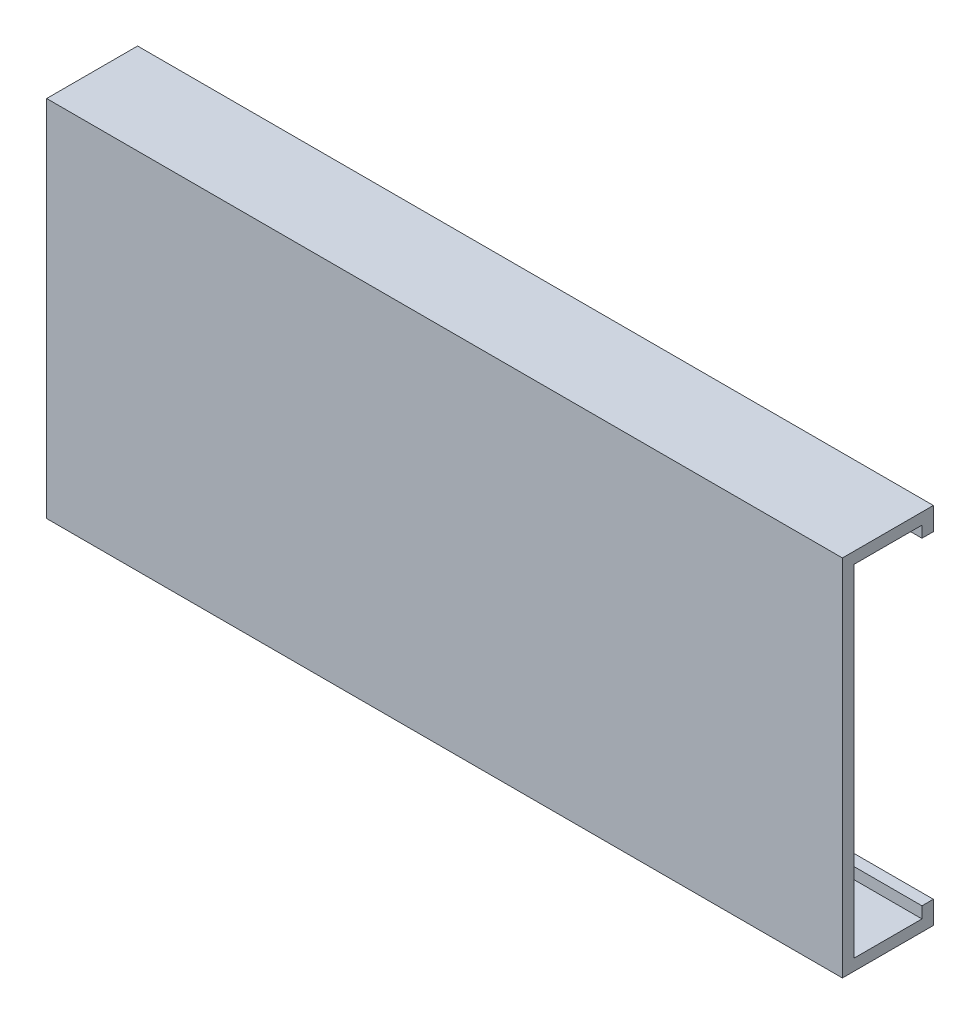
ISO-10303-21;
HEADER;
FILE_DESCRIPTION(('STEP AP214'),'2;1');
FILE_NAME('part.step','',(''),(''),'','','');
FILE_SCHEMA(('AUTOMOTIVE_DESIGN { 1 0 10303 214 1 1 1 1 }'));
ENDSEC;
DATA;
#1=APPLICATION_CONTEXT('core data for automotive mechanical design processes');
#2=APPLICATION_PROTOCOL_DEFINITION('international standard','automotive_design',2000,#1);
#3=PRODUCT_CONTEXT('',#1,'mechanical');
#4=PRODUCT('Part','Part','',(#3));
#5=PRODUCT_RELATED_PRODUCT_CATEGORY('part','',(#4));
#6=PRODUCT_DEFINITION_FORMATION('','',#4);
#7=PRODUCT_DEFINITION_CONTEXT('part definition',#1,'design');
#8=PRODUCT_DEFINITION('design','',#6,#7);
#9=PRODUCT_DEFINITION_SHAPE('','',#8);
#10=(LENGTH_UNIT() NAMED_UNIT(*) SI_UNIT(.MILLI.,.METRE.));
#11=(NAMED_UNIT(*) PLANE_ANGLE_UNIT() SI_UNIT($,.RADIAN.));
#12=(NAMED_UNIT(*) SI_UNIT($,.STERADIAN.) SOLID_ANGLE_UNIT());
#13=UNCERTAINTY_MEASURE_WITH_UNIT(LENGTH_MEASURE(1.E-05),#10,'distance_accuracy_value','');
#14=(GEOMETRIC_REPRESENTATION_CONTEXT(3) GLOBAL_UNCERTAINTY_ASSIGNED_CONTEXT((#13)) GLOBAL_UNIT_ASSIGNED_CONTEXT((#10,
#11,#12)) REPRESENTATION_CONTEXT('',''));
#15=CARTESIAN_POINT('',(0.,0.,0.));
#16=DIRECTION('',(0.,0.,1.));
#17=DIRECTION('',(1.,0.,0.));
#18=AXIS2_PLACEMENT_3D('',#15,#16,#17);
#19=CARTESIAN_POINT('',(35.,-15.,1.));
#20=DIRECTION('',(-1.,0.,0.));
#21=DIRECTION('',(0.,0.,1.));
#22=AXIS2_PLACEMENT_3D('',#19,#20,#21);
#23=PLANE('',#22);
#24=DIRECTION('',(0.,1.,0.));
#25=VECTOR('',#24,1.);
#26=CARTESIAN_POINT('',(35.,-15.,0.));
#27=LINE('',#26,#25);
#28=CARTESIAN_POINT('',(35.,-15.,0.));
#29=VERTEX_POINT('',#28);
#30=CARTESIAN_POINT('',(35.,15.,0.));
#31=VERTEX_POINT('',#30);
#32=EDGE_CURVE('E181',#29,#31,#27,.T.);
#33=ORIENTED_EDGE('',*,*,#32,.T.);
#34=DIRECTION('',(0.,0.,-1.));
#35=VECTOR('',#34,1.);
#36=CARTESIAN_POINT('',(35.,15.,1.));
#37=LINE('',#36,#35);
#38=CARTESIAN_POINT('',(35.,15.,-6.));
#39=VERTEX_POINT('',#38);
#40=EDGE_CURVE('E154',#31,#39,#37,.T.);
#41=ORIENTED_EDGE('',*,*,#40,.T.);
#42=DIRECTION('',(0.,-1.,0.));
#43=VECTOR('',#42,1.);
#44=CARTESIAN_POINT('',(35.,15.,-6.));
#45=LINE('',#44,#43);
#46=CARTESIAN_POINT('',(35.,14.,-6.));
#47=VERTEX_POINT('',#46);
#48=EDGE_CURVE('E202',#39,#47,#45,.T.);
#49=ORIENTED_EDGE('',*,*,#48,.T.);
#50=DIRECTION('',(0.,0.,-1.));
#51=VECTOR('',#50,1.);
#52=CARTESIAN_POINT('',(35.,14.,-7.));
#53=LINE('',#52,#51);
#54=CARTESIAN_POINT('',(35.,14.,-7.));
#55=VERTEX_POINT('',#54);
#56=EDGE_CURVE('E197',#47,#55,#53,.T.);
#57=ORIENTED_EDGE('',*,*,#56,.T.);
#58=DIRECTION('',(0.,-1.,0.));
#59=VECTOR('',#58,1.);
#60=CARTESIAN_POINT('',(35.,16.,-7.));
#61=LINE('',#60,#59);
#62=CARTESIAN_POINT('',(35.,16.,-7.));
#63=VERTEX_POINT('',#62);
#64=EDGE_CURVE('E179',#63,#55,#61,.T.);
#65=ORIENTED_EDGE('',*,*,#64,.F.);
#66=DIRECTION('',(0.,0.,-1.));
#67=VECTOR('',#66,1.);
#68=CARTESIAN_POINT('',(35.,16.,1.));
#69=LINE('',#68,#67);
#70=CARTESIAN_POINT('',(35.,16.,1.));
#71=VERTEX_POINT('',#70);
#72=EDGE_CURVE('E171',#71,#63,#69,.T.);
#73=ORIENTED_EDGE('',*,*,#72,.F.);
#74=DIRECTION('',(0.,1.,0.));
#75=VECTOR('',#74,1.);
#76=CARTESIAN_POINT('',(35.,-15.,1.));
#77=LINE('',#76,#75);
#78=CARTESIAN_POINT('',(35.,-16.,1.));
#79=VERTEX_POINT('',#78);
#80=EDGE_CURVE('E47',#79,#71,#77,.T.);
#81=ORIENTED_EDGE('',*,*,#80,.F.);
#82=DIRECTION('',(0.,0.,-1.));
#83=VECTOR('',#82,1.);
#84=CARTESIAN_POINT('',(35.,-16.,1.));
#85=LINE('',#84,#83);
#86=CARTESIAN_POINT('',(35.,-16.,-7.));
#87=VERTEX_POINT('',#86);
#88=EDGE_CURVE('E163',#79,#87,#85,.T.);
#89=ORIENTED_EDGE('',*,*,#88,.T.);
#90=DIRECTION('',(0.,-1.,0.));
#91=VECTOR('',#90,1.);
#92=CARTESIAN_POINT('',(35.,-15.,-7.));
#93=LINE('',#92,#91);
#94=CARTESIAN_POINT('',(35.,-14.,-7.));
#95=VERTEX_POINT('',#94);
#96=EDGE_CURVE('E212',#95,#87,#93,.T.);
#97=ORIENTED_EDGE('',*,*,#96,.F.);
#98=DIRECTION('',(0.,0.,1.));
#99=VECTOR('',#98,1.);
#100=CARTESIAN_POINT('',(35.,-14.,-7.));
#101=LINE('',#100,#99);
#102=CARTESIAN_POINT('',(35.,-14.,-6.));
#103=VERTEX_POINT('',#102);
#104=EDGE_CURVE('E145',#95,#103,#101,.T.);
#105=ORIENTED_EDGE('',*,*,#104,.T.);
#106=DIRECTION('',(0.,-1.,0.));
#107=VECTOR('',#106,1.);
#108=CARTESIAN_POINT('',(35.,-15.,-6.));
#109=LINE('',#108,#107);
#110=CARTESIAN_POINT('',(35.,-15.,-6.));
#111=VERTEX_POINT('',#110);
#112=EDGE_CURVE('E132',#103,#111,#109,.T.);
#113=ORIENTED_EDGE('',*,*,#112,.T.);
#114=DIRECTION('',(0.,0.,-1.));
#115=VECTOR('',#114,1.);
#116=CARTESIAN_POINT('',(35.,-15.,1.));
#117=LINE('',#116,#115);
#118=EDGE_CURVE('E143',#29,#111,#117,.T.);
#119=ORIENTED_EDGE('',*,*,#118,.F.);
#120=EDGE_LOOP('',(#33,#41,#49,#57,#65,#73,#81,#89,#97,#105,#113,#119));
#121=FACE_BOUND('',#120,.T.);
#122=ADVANCED_FACE('F39',(#121),#23,.F.);
#123=CARTESIAN_POINT('',(-35.,-15.,1.));
#124=DIRECTION('',(1.,0.,0.));
#125=DIRECTION('',(0.,0.,-1.));
#126=AXIS2_PLACEMENT_3D('',#123,#124,#125);
#127=PLANE('',#126);
#128=DIRECTION('',(0.,-1.,0.));
#129=VECTOR('',#128,1.);
#130=CARTESIAN_POINT('',(-35.,-15.,0.));
#131=LINE('',#130,#129);
#132=CARTESIAN_POINT('',(-35.,15.,0.));
#133=VERTEX_POINT('',#132);
#134=CARTESIAN_POINT('',(-35.,-15.,0.));
#135=VERTEX_POINT('',#134);
#136=EDGE_CURVE('E55',#133,#135,#131,.T.);
#137=ORIENTED_EDGE('',*,*,#136,.T.);
#138=DIRECTION('',(0.,0.,-1.));
#139=VECTOR('',#138,1.);
#140=CARTESIAN_POINT('',(-35.,-15.,1.));
#141=LINE('',#140,#139);
#142=CARTESIAN_POINT('',(-35.,-15.,-6.));
#143=VERTEX_POINT('',#142);
#144=EDGE_CURVE('E151',#135,#143,#141,.T.);
#145=ORIENTED_EDGE('',*,*,#144,.T.);
#146=DIRECTION('',(0.,-1.,0.));
#147=VECTOR('',#146,1.);
#148=CARTESIAN_POINT('',(-35.,-15.,-6.));
#149=LINE('',#148,#147);
#150=CARTESIAN_POINT('',(-35.,-14.,-6.));
#151=VERTEX_POINT('',#150);
#152=EDGE_CURVE('E135',#151,#143,#149,.T.);
#153=ORIENTED_EDGE('',*,*,#152,.F.);
#154=DIRECTION('',(0.,0.,1.));
#155=VECTOR('',#154,1.);
#156=CARTESIAN_POINT('',(-35.,-14.,-7.));
#157=LINE('',#156,#155);
#158=CARTESIAN_POINT('',(-35.,-14.,-7.));
#159=VERTEX_POINT('',#158);
#160=EDGE_CURVE('E146',#159,#151,#157,.T.);
#161=ORIENTED_EDGE('',*,*,#160,.F.);
#162=DIRECTION('',(0.,1.,0.));
#163=VECTOR('',#162,1.);
#164=CARTESIAN_POINT('',(-35.,-15.,-7.));
#165=LINE('',#164,#163);
#166=CARTESIAN_POINT('',(-35.,-16.,-7.));
#167=VERTEX_POINT('',#166);
#168=EDGE_CURVE('E220',#167,#159,#165,.T.);
#169=ORIENTED_EDGE('',*,*,#168,.F.);
#170=DIRECTION('',(0.,0.,-1.));
#171=VECTOR('',#170,1.);
#172=CARTESIAN_POINT('',(-35.,-16.,1.));
#173=LINE('',#172,#171);
#174=CARTESIAN_POINT('',(-35.,-16.,1.));
#175=VERTEX_POINT('',#174);
#176=EDGE_CURVE('E156',#175,#167,#173,.T.);
#177=ORIENTED_EDGE('',*,*,#176,.F.);
#178=DIRECTION('',(0.,-1.,0.));
#179=VECTOR('',#178,1.);
#180=CARTESIAN_POINT('',(-35.,-15.,1.));
#181=LINE('',#180,#179);
#182=CARTESIAN_POINT('',(-35.,16.,1.));
#183=VERTEX_POINT('',#182);
#184=EDGE_CURVE('E11',#183,#175,#181,.T.);
#185=ORIENTED_EDGE('',*,*,#184,.F.);
#186=DIRECTION('',(0.,0.,-1.));
#187=VECTOR('',#186,1.);
#188=CARTESIAN_POINT('',(-35.,16.,1.));
#189=LINE('',#188,#187);
#190=CARTESIAN_POINT('',(-35.,16.,-7.));
#191=VERTEX_POINT('',#190);
#192=EDGE_CURVE('E165',#183,#191,#189,.T.);
#193=ORIENTED_EDGE('',*,*,#192,.T.);
#194=DIRECTION('',(0.,-1.,0.));
#195=VECTOR('',#194,1.);
#196=CARTESIAN_POINT('',(-35.,16.,-7.));
#197=LINE('',#196,#195);
#198=CARTESIAN_POINT('',(-35.,14.,-7.));
#199=VERTEX_POINT('',#198);
#200=EDGE_CURVE('E175',#191,#199,#197,.T.);
#201=ORIENTED_EDGE('',*,*,#200,.T.);
#202=DIRECTION('',(0.,0.,-1.));
#203=VECTOR('',#202,1.);
#204=CARTESIAN_POINT('',(-35.,14.,-7.));
#205=LINE('',#204,#203);
#206=CARTESIAN_POINT('',(-35.,14.,-6.));
#207=VERTEX_POINT('',#206);
#208=EDGE_CURVE('E195',#207,#199,#205,.T.);
#209=ORIENTED_EDGE('',*,*,#208,.F.);
#210=DIRECTION('',(0.,-1.,0.));
#211=VECTOR('',#210,1.);
#212=CARTESIAN_POINT('',(-35.,15.,-6.));
#213=LINE('',#212,#211);
#214=CARTESIAN_POINT('',(-35.,15.,-6.));
#215=VERTEX_POINT('',#214);
#216=EDGE_CURVE('E193',#215,#207,#213,.T.);
#217=ORIENTED_EDGE('',*,*,#216,.F.);
#218=DIRECTION('',(0.,0.,-1.));
#219=VECTOR('',#218,1.);
#220=CARTESIAN_POINT('',(-35.,15.,1.));
#221=LINE('',#220,#219);
#222=EDGE_CURVE('E150',#133,#215,#221,.T.);
#223=ORIENTED_EDGE('',*,*,#222,.F.);
#224=EDGE_LOOP('',(#137,#145,#153,#161,#169,#177,#185,#193,#201,#209,#217,#223));
#225=FACE_BOUND('',#224,.T.);
#226=ADVANCED_FACE('F190',(#225),#127,.F.);
#227=CARTESIAN_POINT('',(0.,0.,1.));
#228=DIRECTION('',(0.,0.,-1.));
#229=DIRECTION('',(-1.,0.,0.));
#230=AXIS2_PLACEMENT_3D('',#227,#228,#229);
#231=PLANE('',#230);
#232=ORIENTED_EDGE('',*,*,#80,.T.);
#233=DIRECTION('',(1.,0.,0.));
#234=VECTOR('',#233,1.);
#235=CARTESIAN_POINT('',(-35.,16.,1.));
#236=LINE('',#235,#234);
#237=EDGE_CURVE('E173',#183,#71,#236,.T.);
#238=ORIENTED_EDGE('',*,*,#237,.F.);
#239=ORIENTED_EDGE('',*,*,#184,.T.);
#240=DIRECTION('',(-1.,0.,0.));
#241=VECTOR('',#240,1.);
#242=CARTESIAN_POINT('',(35.,-16.,1.));
#243=LINE('',#242,#241);
#244=EDGE_CURVE('E159',#79,#175,#243,.T.);
#245=ORIENTED_EDGE('',*,*,#244,.F.);
#246=EDGE_LOOP('',(#232,#238,#239,#245));
#247=FACE_BOUND('',#246,.T.);
#248=ADVANCED_FACE('F233',(#247),#231,.F.);
#249=CARTESIAN_POINT('',(0.,0.,0.));
#250=DIRECTION('',(0.,0.,-1.));
#251=DIRECTION('',(-1.,0.,0.));
#252=AXIS2_PLACEMENT_3D('',#249,#250,#251);
#253=PLANE('',#252);
#254=ORIENTED_EDGE('',*,*,#32,.F.);
#255=DIRECTION('',(1.,0.,0.));
#256=VECTOR('',#255,1.);
#257=CARTESIAN_POINT('',(-35.,-15.,0.));
#258=LINE('',#257,#256);
#259=EDGE_CURVE('E42',#135,#29,#258,.T.);
#260=ORIENTED_EDGE('',*,*,#259,.F.);
#261=ORIENTED_EDGE('',*,*,#136,.F.);
#262=DIRECTION('',(-1.,0.,0.));
#263=VECTOR('',#262,1.);
#264=CARTESIAN_POINT('',(-35.,15.,0.));
#265=LINE('',#264,#263);
#266=EDGE_CURVE('E62',#31,#133,#265,.T.);
#267=ORIENTED_EDGE('',*,*,#266,.F.);
#268=EDGE_LOOP('',(#254,#260,#261,#267));
#269=FACE_BOUND('',#268,.T.);
#270=ADVANCED_FACE('F257',(#269),#253,.T.);
#271=CARTESIAN_POINT('',(-35.,16.,-7.));
#272=DIRECTION('',(0.,0.,-1.));
#273=DIRECTION('',(-1.,0.,0.));
#274=AXIS2_PLACEMENT_3D('',#271,#272,#273);
#275=PLANE('',#274);
#276=ORIENTED_EDGE('',*,*,#64,.T.);
#277=DIRECTION('',(1.,0.,0.));
#278=VECTOR('',#277,1.);
#279=CARTESIAN_POINT('',(-35.,14.,-7.));
#280=LINE('',#279,#278);
#281=EDGE_CURVE('E209',#199,#55,#280,.T.);
#282=ORIENTED_EDGE('',*,*,#281,.F.);
#283=ORIENTED_EDGE('',*,*,#200,.F.);
#284=DIRECTION('',(1.,0.,0.));
#285=VECTOR('',#284,1.);
#286=CARTESIAN_POINT('',(-35.,16.,-7.));
#287=LINE('',#286,#285);
#288=EDGE_CURVE('E168',#191,#63,#287,.T.);
#289=ORIENTED_EDGE('',*,*,#288,.T.);
#290=EDGE_LOOP('',(#276,#282,#283,#289));
#291=FACE_BOUND('',#290,.T.);
#292=ADVANCED_FACE('F252',(#291),#275,.T.);
#293=CARTESIAN_POINT('',(0.,16.,0.));
#294=DIRECTION('',(0.,-1.,0.));
#295=DIRECTION('',(0.,0.,-1.));
#296=AXIS2_PLACEMENT_3D('',#293,#294,#295);
#297=PLANE('',#296);
#298=ORIENTED_EDGE('',*,*,#192,.F.);
#299=ORIENTED_EDGE('',*,*,#237,.T.);
#300=ORIENTED_EDGE('',*,*,#72,.T.);
#301=ORIENTED_EDGE('',*,*,#288,.F.);
#302=EDGE_LOOP('',(#298,#299,#300,#301));
#303=FACE_BOUND('',#302,.T.);
#304=ADVANCED_FACE('F249',(#303),#297,.F.);
#305=CARTESIAN_POINT('',(0.,15.,0.));
#306=DIRECTION('',(0.,-1.,0.));
#307=DIRECTION('',(0.,0.,-1.));
#308=AXIS2_PLACEMENT_3D('',#305,#306,#307);
#309=PLANE('',#308);
#310=DIRECTION('',(1.,0.,0.));
#311=VECTOR('',#310,1.);
#312=CARTESIAN_POINT('',(-35.,15.,-6.));
#313=LINE('',#312,#311);
#314=EDGE_CURVE('E199',#215,#39,#313,.T.);
#315=ORIENTED_EDGE('',*,*,#314,.T.);
#316=ORIENTED_EDGE('',*,*,#40,.F.);
#317=ORIENTED_EDGE('',*,*,#266,.T.);
#318=ORIENTED_EDGE('',*,*,#222,.T.);
#319=EDGE_LOOP('',(#315,#316,#317,#318));
#320=FACE_BOUND('',#319,.T.);
#321=ADVANCED_FACE('F188',(#320),#309,.T.);
#322=CARTESIAN_POINT('',(35.,-15.,1.));
#323=DIRECTION('',(0.,1.,0.));
#324=DIRECTION('',(0.,0.,1.));
#325=AXIS2_PLACEMENT_3D('',#322,#323,#324);
#326=PLANE('',#325);
#327=DIRECTION('',(1.,0.,0.));
#328=VECTOR('',#327,1.);
#329=CARTESIAN_POINT('',(-35.,-15.,-6.));
#330=LINE('',#329,#328);
#331=EDGE_CURVE('E129',#143,#111,#330,.T.);
#332=ORIENTED_EDGE('',*,*,#331,.F.);
#333=ORIENTED_EDGE('',*,*,#144,.F.);
#334=ORIENTED_EDGE('',*,*,#259,.T.);
#335=ORIENTED_EDGE('',*,*,#118,.T.);
#336=EDGE_LOOP('',(#332,#333,#334,#335));
#337=FACE_BOUND('',#336,.T.);
#338=ADVANCED_FACE('F149',(#337),#326,.T.);
#339=CARTESIAN_POINT('',(35.,-16.,1.));
#340=DIRECTION('',(0.,-1.,0.));
#341=DIRECTION('',(1.,0.,0.));
#342=AXIS2_PLACEMENT_3D('',#339,#340,#341);
#343=PLANE('',#342);
#344=ORIENTED_EDGE('',*,*,#176,.T.);
#345=DIRECTION('',(-1.,0.,0.));
#346=VECTOR('',#345,1.);
#347=CARTESIAN_POINT('',(35.,-16.,-7.));
#348=LINE('',#347,#346);
#349=EDGE_CURVE('E218',#87,#167,#348,.T.);
#350=ORIENTED_EDGE('',*,*,#349,.F.);
#351=ORIENTED_EDGE('',*,*,#88,.F.);
#352=ORIENTED_EDGE('',*,*,#244,.T.);
#353=EDGE_LOOP('',(#344,#350,#351,#352));
#354=FACE_BOUND('',#353,.T.);
#355=ADVANCED_FACE('F229',(#354),#343,.T.);
#356=CARTESIAN_POINT('',(0.,0.,-7.));
#357=DIRECTION('',(0.,0.,-1.));
#358=DIRECTION('',(-1.,0.,0.));
#359=AXIS2_PLACEMENT_3D('',#356,#357,#358);
#360=PLANE('',#359);
#361=ORIENTED_EDGE('',*,*,#96,.T.);
#362=ORIENTED_EDGE('',*,*,#349,.T.);
#363=ORIENTED_EDGE('',*,*,#168,.T.);
#364=DIRECTION('',(1.,0.,0.));
#365=VECTOR('',#364,1.);
#366=CARTESIAN_POINT('',(-35.,-14.,-7.));
#367=LINE('',#366,#365);
#368=EDGE_CURVE('E239',#159,#95,#367,.T.);
#369=ORIENTED_EDGE('',*,*,#368,.T.);
#370=EDGE_LOOP('',(#361,#362,#363,#369));
#371=FACE_BOUND('',#370,.T.);
#372=ADVANCED_FACE('F244',(#371),#360,.T.);
#373=CARTESIAN_POINT('',(-35.,14.,-7.));
#374=DIRECTION('',(0.,-1.,0.));
#375=DIRECTION('',(0.,0.,-1.));
#376=AXIS2_PLACEMENT_3D('',#373,#374,#375);
#377=PLANE('',#376);
#378=ORIENTED_EDGE('',*,*,#56,.F.);
#379=DIRECTION('',(1.,0.,0.));
#380=VECTOR('',#379,1.);
#381=CARTESIAN_POINT('',(-35.,14.,-6.));
#382=LINE('',#381,#380);
#383=EDGE_CURVE('E213',#207,#47,#382,.T.);
#384=ORIENTED_EDGE('',*,*,#383,.F.);
#385=ORIENTED_EDGE('',*,*,#208,.T.);
#386=ORIENTED_EDGE('',*,*,#281,.T.);
#387=EDGE_LOOP('',(#378,#384,#385,#386));
#388=FACE_BOUND('',#387,.T.);
#389=ADVANCED_FACE('F255',(#388),#377,.T.);
#390=CARTESIAN_POINT('',(-35.,15.,-6.));
#391=DIRECTION('',(0.,0.,1.));
#392=DIRECTION('',(1.,0.,0.));
#393=AXIS2_PLACEMENT_3D('',#390,#391,#392);
#394=PLANE('',#393);
#395=ORIENTED_EDGE('',*,*,#48,.F.);
#396=ORIENTED_EDGE('',*,*,#314,.F.);
#397=ORIENTED_EDGE('',*,*,#216,.T.);
#398=ORIENTED_EDGE('',*,*,#383,.T.);
#399=EDGE_LOOP('',(#395,#396,#397,#398));
#400=FACE_BOUND('',#399,.T.);
#401=ADVANCED_FACE('F256',(#400),#394,.T.);
#402=CARTESIAN_POINT('',(-35.,-15.,-6.));
#403=DIRECTION('',(0.,0.,1.));
#404=DIRECTION('',(1.,0.,0.));
#405=AXIS2_PLACEMENT_3D('',#402,#403,#404);
#406=PLANE('',#405);
#407=ORIENTED_EDGE('',*,*,#112,.F.);
#408=DIRECTION('',(1.,0.,0.));
#409=VECTOR('',#408,1.);
#410=CARTESIAN_POINT('',(-35.,-14.,-6.));
#411=LINE('',#410,#409);
#412=EDGE_CURVE('E139',#151,#103,#411,.T.);
#413=ORIENTED_EDGE('',*,*,#412,.F.);
#414=ORIENTED_EDGE('',*,*,#152,.T.);
#415=ORIENTED_EDGE('',*,*,#331,.T.);
#416=EDGE_LOOP('',(#407,#413,#414,#415));
#417=FACE_BOUND('',#416,.T.);
#418=ADVANCED_FACE('F131',(#417),#406,.T.);
#419=CARTESIAN_POINT('',(-35.,-14.,-7.));
#420=DIRECTION('',(0.,1.,0.));
#421=DIRECTION('',(0.,0.,1.));
#422=AXIS2_PLACEMENT_3D('',#419,#420,#421);
#423=PLANE('',#422);
#424=ORIENTED_EDGE('',*,*,#104,.F.);
#425=ORIENTED_EDGE('',*,*,#368,.F.);
#426=ORIENTED_EDGE('',*,*,#160,.T.);
#427=ORIENTED_EDGE('',*,*,#412,.T.);
#428=EDGE_LOOP('',(#424,#425,#426,#427));
#429=FACE_BOUND('',#428,.T.);
#430=ADVANCED_FACE('F243',(#429),#423,.T.);
#431=CLOSED_SHELL('',(#122,#226,#248,#270,#292,#304,#321,#338,#355,#372,#389,#401,#418,#430));
#432=MANIFOLD_SOLID_BREP('B2',#431);
#433=ADVANCED_BREP_SHAPE_REPRESENTATION('',(#18,#432),#14);
#434=SHAPE_DEFINITION_REPRESENTATION(#9,#433);
ENDSEC;
END-ISO-10303-21;
